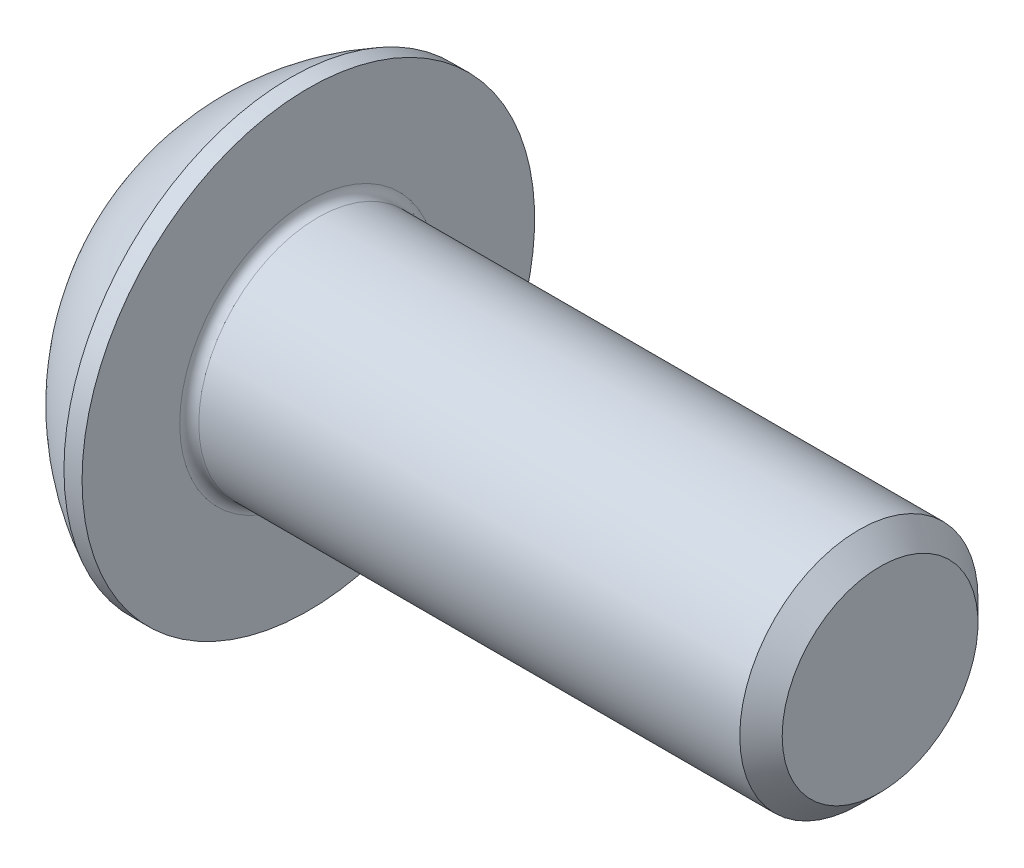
from build123d import *

# Parameters (mm, degrees)
FILLET1_R   = 0.2
HEX_2_DEPTH = 1.56


with BuildPart() as part:
    # BodySke → BaseBody (revolve)
    with BuildSketch(Plane.XY, mode=Mode.PRIVATE) as basebody_sk:
        with BuildLine():
            Line((14.75, 0), (14.75, 2.055))
            Line((14.75, 2.055), (14.305, 2.5))
            Line((14.305, 2.5), (2.75, 2.5))
            Line((2.75, 2.5), (2.75, 4.75))
            Line((2.75, 4.75), (2.37, 4.75))
            ThreePointArc((2.37, 4.75), (0.992680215, 3.754414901), (0, 2.375))
            Line((0, 2.375), (0, 0))
            Line((0, 0), (14.75, 0))
        make_face()
    revolve(basebody_sk.sketch.rotate(Axis((0, 0, 0), (1, 0, 0)), 90), axis=Axis((0, 0, 0), (1, 0, 0)))

    # Fillet1
    fillet1_edges = [part.edges().sort_by_distance(p)[0] for p in [
        (2.75, 0, -2.5),
    ]]
    fillet(fillet1_edges, radius=FILLET1_R)

    # Sketch2 → PreBroach (revolve, cut)
    with BuildSketch(Plane.XY, mode=Mode.PRIVATE) as prebroach_sk:
        Polygon((0, 1.5), (1.56, 1.5), (2.426025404, 0), (0, 0), align=None)
    revolve(prebroach_sk.sketch.rotate(Axis((0, 0, 0), (1, 0, 0)), 90), axis=Axis((0, 0, 0), (1, 0, 0)), mode=Mode.SUBTRACT)

    # Sketch3 → Hex 2 (cut)
    with BuildSketch(Plane(origin=(0, 0, 0), x_dir=(0, 0, -1), z_dir=(1, 0, 0))):
        Polygon((-1.5, -0.866025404), (-1.5, 0.866025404), (0, 1.732050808), (1.5, 0.866025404), (1.5, -0.866025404), (0, -1.732050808), align=None)
    extrude(amount=HEX_2_DEPTH, mode=Mode.SUBTRACT)


solid = part.part
